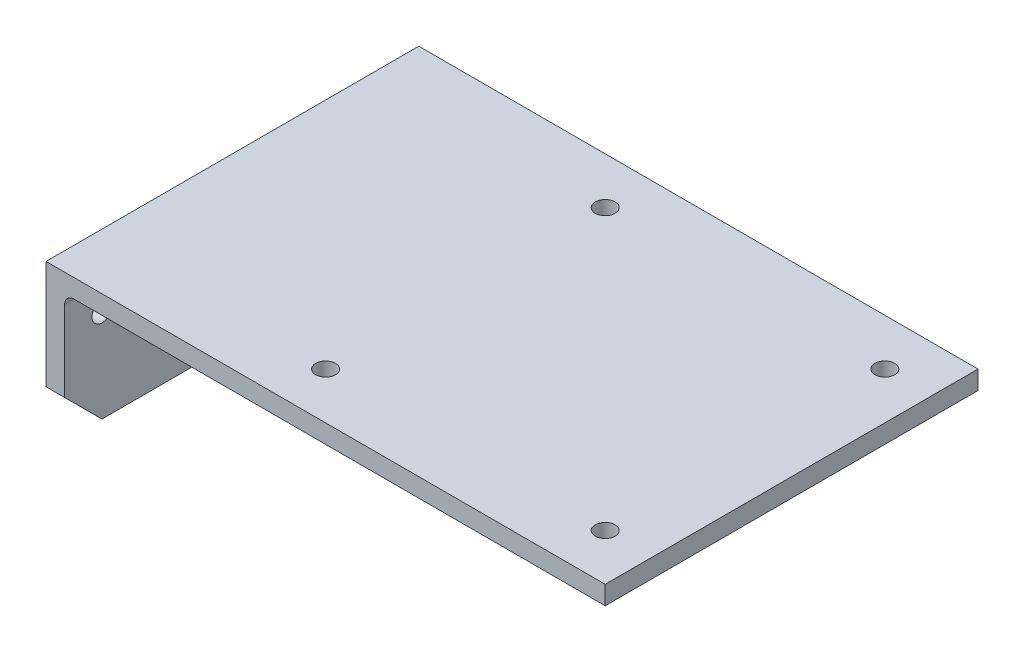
from build123d import *

# Parameters (mm, degrees)
EXTRUDE1_DEPTH     = 127
SKETCH2_R          = 3.375
CUT_EXTRUDE1_DEPTH = 10
SKETCH3_R          = 3.3782
CUT_EXTRUDE2_DEPTH = 230.147204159
CHAMFER1_SIZE      = 12.7
FILLET1_R          = 3.175


with BuildPart() as part:
    # Sketch1 → Extrude1 (new body)
    with BuildSketch(Plane.XY):
        Polygon((-127, 0), (63.5, 0), (63.5, -6.35), (-120.65, -6.35), (-120.65, -49.681170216), (-127, -49.681170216), align=None)
    extrude(amount=-EXTRUDE1_DEPTH)

    # Sketch2 → Cut-Extrude1 (cut)
    with BuildSketch(Plane.XZ.offset(6.35)):
        with Locations((-47.625, -111.125)):
            Circle(SKETCH2_R)
        with Locations((47.625, -111.125)):
            Circle(SKETCH2_R)
        with Locations((47.625, -15.875)):
            Circle(SKETCH2_R)
        with Locations((-47.625, -15.875)):
            Circle(SKETCH2_R)
    extrude(amount=-CUT_EXTRUDE1_DEPTH, mode=Mode.SUBTRACT)

    # Sketch3 → Cut-Extrude2 (cut, through all)
    with BuildSketch(Plane(origin=(-120.65, 0, 0), x_dir=(0, 0, -1), z_dir=(1, 0, 0))):
        with Locations(Location((12.7, -17.931170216, 0), (0, 0, 90))):
            Circle(SKETCH3_R)
        with Locations(Location((63.5, -36.981170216, 0), (0, 0, 90))):
            Circle(SKETCH3_R)
        with Locations(Location((114.3, -17.931170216, 0), (0, 0, 270))):
            Circle(SKETCH3_R)
    extrude(amount=-CUT_EXTRUDE2_DEPTH, mode=Mode.SUBTRACT)

    # Chamfer1
    chamfer1_edges = [part.edges().sort_by_distance(p)[0] for p in [
        (-123.825, -49.681170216, -127),
        (-123.825, -49.681170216, 0),
    ]]
    chamfer(chamfer1_edges, length=CHAMFER1_SIZE)

    # Fillet1
    fillet1_edges = [part.edges().sort_by_distance(p)[0] for p in [
        (-120.65, -6.35, -63.5),
    ]]
    fillet(fillet1_edges, radius=FILLET1_R)


solid = part.part
